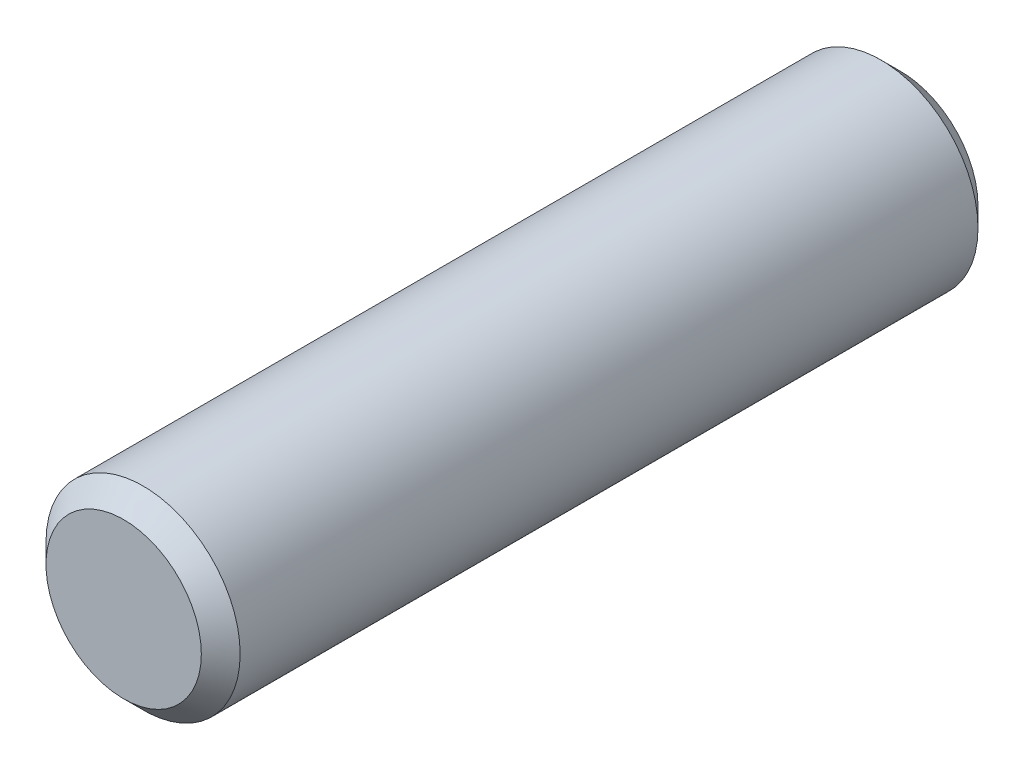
ISO-10303-21;
HEADER;
FILE_DESCRIPTION(('STEP AP214'),'2;1');
FILE_NAME('part.step','',(''),(''),'','','');
FILE_SCHEMA(('AUTOMOTIVE_DESIGN { 1 0 10303 214 1 1 1 1 }'));
ENDSEC;
DATA;
#1=APPLICATION_CONTEXT('core data for automotive mechanical design processes');
#2=APPLICATION_PROTOCOL_DEFINITION('international standard','automotive_design',2000,#1);
#3=PRODUCT_CONTEXT('',#1,'mechanical');
#4=PRODUCT('Part','Part','',(#3));
#5=PRODUCT_RELATED_PRODUCT_CATEGORY('part','',(#4));
#6=PRODUCT_DEFINITION_FORMATION('','',#4);
#7=PRODUCT_DEFINITION_CONTEXT('part definition',#1,'design');
#8=PRODUCT_DEFINITION('design','',#6,#7);
#9=PRODUCT_DEFINITION_SHAPE('','',#8);
#10=(LENGTH_UNIT() NAMED_UNIT(*) SI_UNIT(.MILLI.,.METRE.));
#11=(NAMED_UNIT(*) PLANE_ANGLE_UNIT() SI_UNIT($,.RADIAN.));
#12=(NAMED_UNIT(*) SI_UNIT($,.STERADIAN.) SOLID_ANGLE_UNIT());
#13=UNCERTAINTY_MEASURE_WITH_UNIT(LENGTH_MEASURE(1.E-05),#10,'distance_accuracy_value','');
#14=(GEOMETRIC_REPRESENTATION_CONTEXT(3) GLOBAL_UNCERTAINTY_ASSIGNED_CONTEXT((#13)) GLOBAL_UNIT_ASSIGNED_CONTEXT((#10,
#11,#12)) REPRESENTATION_CONTEXT('',''));
#15=CARTESIAN_POINT('',(0.,0.,0.));
#16=DIRECTION('',(0.,0.,1.));
#17=DIRECTION('',(1.,0.,0.));
#18=AXIS2_PLACEMENT_3D('',#15,#16,#17);
#19=CARTESIAN_POINT('',(-0.866025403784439,0.,1.2));
#20=DIRECTION('',(0.,0.,-1.));
#21=DIRECTION('',(-1.,0.,0.));
#22=AXIS2_PLACEMENT_3D('',#19,#20,#21);
#23=PLANE('',#22);
#24=DIRECTION('',(-1.,0.,0.));
#25=VECTOR('',#24,1.);
#26=CARTESIAN_POINT('',(0.433012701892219,-0.75,1.2));
#27=LINE('',#26,#25);
#28=CARTESIAN_POINT('',(0.433012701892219,-0.75,1.2));
#29=VERTEX_POINT('',#28);
#30=CARTESIAN_POINT('',(0.,-0.75,1.2));
#31=VERTEX_POINT('',#30);
#32=EDGE_CURVE('E174',#29,#31,#27,.T.);
#33=ORIENTED_EDGE('',*,*,#32,.T.);
#34=CARTESIAN_POINT('',(0.,0.,1.2));
#35=DIRECTION('',(0.,0.,1.));
#36=DIRECTION('',(0.,-1.,0.));
#37=AXIS2_PLACEMENT_3D('',#34,#35,#36);
#38=CIRCLE('',#37,0.75);
#39=CARTESIAN_POINT('',(0.649519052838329,-0.375,1.2));
#40=VERTEX_POINT('',#39);
#41=EDGE_CURVE('E48',#31,#40,#38,.T.);
#42=ORIENTED_EDGE('',*,*,#41,.T.);
#43=DIRECTION('',(-0.5,-0.866025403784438,0.));
#44=VECTOR('',#43,1.);
#45=CARTESIAN_POINT('',(0.866025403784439,0.,1.2));
#46=LINE('',#45,#44);
#47=EDGE_CURVE('E170',#40,#29,#46,.T.);
#48=ORIENTED_EDGE('',*,*,#47,.T.);
#49=EDGE_LOOP('',(#33,#42,#48));
#50=FACE_BOUND('',#49,.T.);
#51=ADVANCED_FACE('F33',(#50),#23,.T.);
#52=CARTESIAN_POINT('',(0.866025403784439,0.,1.2));
#53=VERTEX_POINT('',#52);
#54=EDGE_CURVE('E171',#53,#40,#46,.T.);
#55=ORIENTED_EDGE('',*,*,#54,.T.);
#56=CARTESIAN_POINT('',(0.649519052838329,0.375,1.2));
#57=VERTEX_POINT('',#56);
#58=EDGE_CURVE('E192',#40,#57,#38,.T.);
#59=ORIENTED_EDGE('',*,*,#58,.T.);
#60=DIRECTION('',(0.5,-0.866025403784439,0.));
#61=VECTOR('',#60,1.);
#62=CARTESIAN_POINT('',(0.433012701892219,0.75,1.2));
#63=LINE('',#62,#61);
#64=EDGE_CURVE('E166',#57,#53,#63,.T.);
#65=ORIENTED_EDGE('',*,*,#64,.T.);
#66=EDGE_LOOP('',(#55,#59,#65));
#67=FACE_BOUND('',#66,.T.);
#68=ADVANCED_FACE('F123',(#67),#23,.T.);
#69=CARTESIAN_POINT('',(0.433012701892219,0.75,1.2));
#70=VERTEX_POINT('',#69);
#71=EDGE_CURVE('E167',#70,#57,#63,.T.);
#72=ORIENTED_EDGE('',*,*,#71,.T.);
#73=CARTESIAN_POINT('',(0.,0.75,1.2));
#74=VERTEX_POINT('',#73);
#75=EDGE_CURVE('E263',#57,#74,#38,.T.);
#76=ORIENTED_EDGE('',*,*,#75,.T.);
#77=DIRECTION('',(1.,0.,0.));
#78=VECTOR('',#77,1.);
#79=CARTESIAN_POINT('',(-0.433012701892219,0.75,1.2));
#80=LINE('',#79,#78);
#81=EDGE_CURVE('E162',#74,#70,#80,.T.);
#82=ORIENTED_EDGE('',*,*,#81,.T.);
#83=EDGE_LOOP('',(#72,#76,#82));
#84=FACE_BOUND('',#83,.T.);
#85=ADVANCED_FACE('F129',(#84),#23,.T.);
#86=CARTESIAN_POINT('',(-0.433012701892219,0.75,1.2));
#87=VERTEX_POINT('',#86);
#88=EDGE_CURVE('E163',#87,#74,#80,.T.);
#89=ORIENTED_EDGE('',*,*,#88,.T.);
#90=CARTESIAN_POINT('',(-0.649519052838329,0.375,1.2));
#91=VERTEX_POINT('',#90);
#92=EDGE_CURVE('E262',#74,#91,#38,.T.);
#93=ORIENTED_EDGE('',*,*,#92,.T.);
#94=DIRECTION('',(0.5,0.866025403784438,0.));
#95=VECTOR('',#94,1.);
#96=CARTESIAN_POINT('',(-0.866025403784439,0.,1.2));
#97=LINE('',#96,#95);
#98=EDGE_CURVE('E152',#91,#87,#97,.T.);
#99=ORIENTED_EDGE('',*,*,#98,.T.);
#100=EDGE_LOOP('',(#89,#93,#99));
#101=FACE_BOUND('',#100,.T.);
#102=ADVANCED_FACE('F142',(#101),#23,.T.);
#103=CARTESIAN_POINT('',(-0.866025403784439,0.,1.2));
#104=VERTEX_POINT('',#103);
#105=EDGE_CURVE('E155',#104,#91,#97,.T.);
#106=ORIENTED_EDGE('',*,*,#105,.T.);
#107=CARTESIAN_POINT('',(-0.649519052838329,-0.375,1.2));
#108=VERTEX_POINT('',#107);
#109=EDGE_CURVE('E260',#91,#108,#38,.T.);
#110=ORIENTED_EDGE('',*,*,#109,.T.);
#111=DIRECTION('',(-0.5,0.866025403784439,0.));
#112=VECTOR('',#111,1.);
#113=CARTESIAN_POINT('',(-0.43301270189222,-0.75,1.2));
#114=LINE('',#113,#112);
#115=EDGE_CURVE('E153',#108,#104,#114,.T.);
#116=ORIENTED_EDGE('',*,*,#115,.T.);
#117=EDGE_LOOP('',(#106,#110,#116));
#118=FACE_BOUND('',#117,.T.);
#119=ADVANCED_FACE('F134',(#118),#23,.T.);
#120=CARTESIAN_POINT('',(-0.43301270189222,-0.75,1.2));
#121=VERTEX_POINT('',#120);
#122=EDGE_CURVE('E146',#121,#108,#114,.T.);
#123=ORIENTED_EDGE('',*,*,#122,.T.);
#124=EDGE_CURVE('E147',#108,#31,#38,.T.);
#125=ORIENTED_EDGE('',*,*,#124,.T.);
#126=EDGE_CURVE('E149',#31,#121,#27,.T.);
#127=ORIENTED_EDGE('',*,*,#126,.T.);
#128=EDGE_LOOP('',(#123,#125,#127));
#129=FACE_BOUND('',#128,.T.);
#130=ADVANCED_FACE('F125',(#129),#23,.T.);
#131=CARTESIAN_POINT('',(0.,0.,12.));
#132=DIRECTION('',(0.,0.,-1.));
#133=DIRECTION('',(-1.,0.,0.));
#134=AXIS2_PLACEMENT_3D('',#131,#132,#133);
#135=CYLINDRICAL_SURFACE('',#134,1.5);
#136=CARTESIAN_POINT('',(0.,0.,11.7));
#137=DIRECTION('',(0.,0.,1.));
#138=DIRECTION('',(1.,0.,0.));
#139=AXIS2_PLACEMENT_3D('',#136,#137,#138);
#140=CIRCLE('',#139,1.5);
#141=CARTESIAN_POINT('',(1.5,0.,11.7));
#142=VERTEX_POINT('',#141);
#143=EDGE_CURVE('E41',#142,#142,#140,.F.);
#144=ORIENTED_EDGE('',*,*,#143,.T.);
#145=EDGE_LOOP('',(#144));
#146=FACE_BOUND('',#145,.T.);
#147=CARTESIAN_POINT('',(0.,0.,0.299999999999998));
#148=DIRECTION('',(0.,0.,1.));
#149=DIRECTION('',(1.,0.,0.));
#150=AXIS2_PLACEMENT_3D('',#147,#148,#149);
#151=CIRCLE('',#150,1.5);
#152=CARTESIAN_POINT('',(1.5,0.,0.299999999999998));
#153=VERTEX_POINT('',#152);
#154=EDGE_CURVE('E191',#153,#153,#151,.T.);
#155=ORIENTED_EDGE('',*,*,#154,.T.);
#156=EDGE_LOOP('',(#155));
#157=FACE_BOUND('',#156,.T.);
#158=ADVANCED_FACE('F35',(#146,#157),#135,.T.);
#159=CARTESIAN_POINT('',(0.,0.,12.));
#160=DIRECTION('',(0.,0.,1.));
#161=DIRECTION('',(1.,0.,0.));
#162=AXIS2_PLACEMENT_3D('',#159,#160,#161);
#163=PLANE('',#162);
#164=CARTESIAN_POINT('',(0.,0.,12.));
#165=DIRECTION('',(0.,0.,1.));
#166=DIRECTION('',(1.,0.,0.));
#167=AXIS2_PLACEMENT_3D('',#164,#165,#166);
#168=CIRCLE('',#167,1.2);
#169=CARTESIAN_POINT('',(1.2,0.,12.));
#170=VERTEX_POINT('',#169);
#171=EDGE_CURVE('E188',#170,#170,#168,.T.);
#172=ORIENTED_EDGE('',*,*,#171,.T.);
#173=EDGE_LOOP('',(#172));
#174=FACE_BOUND('',#173,.T.);
#175=ADVANCED_FACE('F140',(#174),#163,.T.);
#176=CARTESIAN_POINT('',(0.,0.,0.));
#177=DIRECTION('',(0.,0.,1.));
#178=DIRECTION('',(1.,0.,0.));
#179=AXIS2_PLACEMENT_3D('',#176,#177,#178);
#180=PLANE('',#179);
#181=CARTESIAN_POINT('',(0.,0.,0.));
#182=DIRECTION('',(0.,0.,1.));
#183=DIRECTION('',(1.,0.,0.));
#184=AXIS2_PLACEMENT_3D('',#181,#182,#183);
#185=CIRCLE('',#184,1.2);
#186=CARTESIAN_POINT('',(1.2,0.,0.));
#187=VERTEX_POINT('',#186);
#188=EDGE_CURVE('E11',#187,#187,#185,.F.);
#189=ORIENTED_EDGE('',*,*,#188,.T.);
#190=EDGE_LOOP('',(#189));
#191=FACE_BOUND('',#190,.T.);
#192=DIRECTION('',(0.5,0.866025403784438,0.));
#193=VECTOR('',#192,1.);
#194=CARTESIAN_POINT('',(-0.866025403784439,0.,0.));
#195=LINE('',#194,#193);
#196=CARTESIAN_POINT('',(-0.866025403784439,0.,0.));
#197=VERTEX_POINT('',#196);
#198=CARTESIAN_POINT('',(-0.433012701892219,0.75,0.));
#199=VERTEX_POINT('',#198);
#200=EDGE_CURVE('E237',#197,#199,#195,.T.);
#201=ORIENTED_EDGE('',*,*,#200,.F.);
#202=DIRECTION('',(-0.5,0.866025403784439,0.));
#203=VECTOR('',#202,1.);
#204=CARTESIAN_POINT('',(-0.43301270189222,-0.75,0.));
#205=LINE('',#204,#203);
#206=CARTESIAN_POINT('',(-0.43301270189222,-0.75,0.));
#207=VERTEX_POINT('',#206);
#208=EDGE_CURVE('E56',#207,#197,#205,.T.);
#209=ORIENTED_EDGE('',*,*,#208,.F.);
#210=DIRECTION('',(-1.,0.,0.));
#211=VECTOR('',#210,1.);
#212=CARTESIAN_POINT('',(0.433012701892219,-0.75,0.));
#213=LINE('',#212,#211);
#214=CARTESIAN_POINT('',(0.433012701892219,-0.75,0.));
#215=VERTEX_POINT('',#214);
#216=EDGE_CURVE('E157',#215,#207,#213,.T.);
#217=ORIENTED_EDGE('',*,*,#216,.F.);
#218=DIRECTION('',(-0.5,-0.866025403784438,0.));
#219=VECTOR('',#218,1.);
#220=CARTESIAN_POINT('',(0.866025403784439,0.,0.));
#221=LINE('',#220,#219);
#222=CARTESIAN_POINT('',(0.866025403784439,0.,0.));
#223=VERTEX_POINT('',#222);
#224=EDGE_CURVE('E233',#223,#215,#221,.T.);
#225=ORIENTED_EDGE('',*,*,#224,.F.);
#226=DIRECTION('',(0.5,-0.866025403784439,0.));
#227=VECTOR('',#226,1.);
#228=CARTESIAN_POINT('',(0.433012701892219,0.75,0.));
#229=LINE('',#228,#227);
#230=CARTESIAN_POINT('',(0.433012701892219,0.75,0.));
#231=VERTEX_POINT('',#230);
#232=EDGE_CURVE('E245',#231,#223,#229,.T.);
#233=ORIENTED_EDGE('',*,*,#232,.F.);
#234=DIRECTION('',(1.,0.,0.));
#235=VECTOR('',#234,1.);
#236=CARTESIAN_POINT('',(-0.433012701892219,0.75,0.));
#237=LINE('',#236,#235);
#238=EDGE_CURVE('E239',#199,#231,#237,.T.);
#239=ORIENTED_EDGE('',*,*,#238,.F.);
#240=EDGE_LOOP('',(#201,#209,#217,#225,#233,#239));
#241=FACE_BOUND('',#240,.T.);
#242=ADVANCED_FACE('F201',(#191,#241),#180,.F.);
#243=CARTESIAN_POINT('',(-0.43301270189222,-0.75,1.2));
#244=DIRECTION('',(-0.866025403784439,-0.5,0.));
#245=DIRECTION('',(0.5,-0.866025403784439,0.));
#246=AXIS2_PLACEMENT_3D('',#243,#244,#245);
#247=PLANE('',#246);
#248=ORIENTED_EDGE('',*,*,#208,.T.);
#249=DIRECTION('',(0.,0.,-1.));
#250=VECTOR('',#249,1.);
#251=CARTESIAN_POINT('',(-0.866025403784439,0.,1.2));
#252=LINE('',#251,#250);
#253=EDGE_CURVE('E176',#104,#197,#252,.T.);
#254=ORIENTED_EDGE('',*,*,#253,.F.);
#255=ORIENTED_EDGE('',*,*,#115,.F.);
#256=ORIENTED_EDGE('',*,*,#122,.F.);
#257=DIRECTION('',(0.,0.,-1.));
#258=VECTOR('',#257,1.);
#259=CARTESIAN_POINT('',(-0.43301270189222,-0.75,1.2));
#260=LINE('',#259,#258);
#261=EDGE_CURVE('E177',#121,#207,#260,.T.);
#262=ORIENTED_EDGE('',*,*,#261,.T.);
#263=EDGE_LOOP('',(#248,#254,#255,#256,#262));
#264=FACE_BOUND('',#263,.T.);
#265=ADVANCED_FACE('F205',(#264),#247,.F.);
#266=CARTESIAN_POINT('',(0.433012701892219,-0.75,1.2));
#267=DIRECTION('',(0.,-1.,0.));
#268=DIRECTION('',(1.,0.,0.));
#269=AXIS2_PLACEMENT_3D('',#266,#267,#268);
#270=PLANE('',#269);
#271=ORIENTED_EDGE('',*,*,#216,.T.);
#272=ORIENTED_EDGE('',*,*,#261,.F.);
#273=ORIENTED_EDGE('',*,*,#126,.F.);
#274=ORIENTED_EDGE('',*,*,#32,.F.);
#275=DIRECTION('',(0.,0.,-1.));
#276=VECTOR('',#275,1.);
#277=CARTESIAN_POINT('',(0.433012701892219,-0.75,1.2));
#278=LINE('',#277,#276);
#279=EDGE_CURVE('E179',#29,#215,#278,.T.);
#280=ORIENTED_EDGE('',*,*,#279,.T.);
#281=EDGE_LOOP('',(#271,#272,#273,#274,#280));
#282=FACE_BOUND('',#281,.T.);
#283=ADVANCED_FACE('F210',(#282),#270,.F.);
#284=CARTESIAN_POINT('',(0.866025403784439,0.,1.2));
#285=DIRECTION('',(0.866025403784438,-0.5,0.));
#286=DIRECTION('',(0.5,0.866025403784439,0.));
#287=AXIS2_PLACEMENT_3D('',#284,#285,#286);
#288=PLANE('',#287);
#289=ORIENTED_EDGE('',*,*,#224,.T.);
#290=ORIENTED_EDGE('',*,*,#279,.F.);
#291=ORIENTED_EDGE('',*,*,#47,.F.);
#292=ORIENTED_EDGE('',*,*,#54,.F.);
#293=DIRECTION('',(0.,0.,-1.));
#294=VECTOR('',#293,1.);
#295=CARTESIAN_POINT('',(0.866025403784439,0.,1.2));
#296=LINE('',#295,#294);
#297=EDGE_CURVE('E181',#53,#223,#296,.T.);
#298=ORIENTED_EDGE('',*,*,#297,.T.);
#299=EDGE_LOOP('',(#289,#290,#291,#292,#298));
#300=FACE_BOUND('',#299,.T.);
#301=ADVANCED_FACE('F218',(#300),#288,.F.);
#302=CARTESIAN_POINT('',(0.433012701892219,0.75,1.2));
#303=DIRECTION('',(0.866025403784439,0.5,0.));
#304=DIRECTION('',(-0.5,0.866025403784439,0.));
#305=AXIS2_PLACEMENT_3D('',#302,#303,#304);
#306=PLANE('',#305);
#307=ORIENTED_EDGE('',*,*,#232,.T.);
#308=ORIENTED_EDGE('',*,*,#297,.F.);
#309=ORIENTED_EDGE('',*,*,#64,.F.);
#310=ORIENTED_EDGE('',*,*,#71,.F.);
#311=DIRECTION('',(0.,0.,-1.));
#312=VECTOR('',#311,1.);
#313=CARTESIAN_POINT('',(0.433012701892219,0.75,1.2));
#314=LINE('',#313,#312);
#315=EDGE_CURVE('E183',#70,#231,#314,.T.);
#316=ORIENTED_EDGE('',*,*,#315,.T.);
#317=EDGE_LOOP('',(#307,#308,#309,#310,#316));
#318=FACE_BOUND('',#317,.T.);
#319=ADVANCED_FACE('F214',(#318),#306,.F.);
#320=CARTESIAN_POINT('',(-0.433012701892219,0.75,1.2));
#321=DIRECTION('',(0.,1.,0.));
#322=DIRECTION('',(0.,0.,1.));
#323=AXIS2_PLACEMENT_3D('',#320,#321,#322);
#324=PLANE('',#323);
#325=ORIENTED_EDGE('',*,*,#238,.T.);
#326=ORIENTED_EDGE('',*,*,#315,.F.);
#327=ORIENTED_EDGE('',*,*,#81,.F.);
#328=ORIENTED_EDGE('',*,*,#88,.F.);
#329=DIRECTION('',(0.,0.,-1.));
#330=VECTOR('',#329,1.);
#331=CARTESIAN_POINT('',(-0.433012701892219,0.75,1.2));
#332=LINE('',#331,#330);
#333=EDGE_CURVE('E185',#87,#199,#332,.T.);
#334=ORIENTED_EDGE('',*,*,#333,.T.);
#335=EDGE_LOOP('',(#325,#326,#327,#328,#334));
#336=FACE_BOUND('',#335,.T.);
#337=ADVANCED_FACE('F118',(#336),#324,.F.);
#338=CARTESIAN_POINT('',(-0.866025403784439,0.,1.2));
#339=DIRECTION('',(-0.866025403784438,0.5,0.));
#340=DIRECTION('',(-0.5,-0.866025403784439,0.));
#341=AXIS2_PLACEMENT_3D('',#338,#339,#340);
#342=PLANE('',#341);
#343=ORIENTED_EDGE('',*,*,#200,.T.);
#344=ORIENTED_EDGE('',*,*,#333,.F.);
#345=ORIENTED_EDGE('',*,*,#98,.F.);
#346=ORIENTED_EDGE('',*,*,#105,.F.);
#347=ORIENTED_EDGE('',*,*,#253,.T.);
#348=EDGE_LOOP('',(#343,#344,#345,#346,#347));
#349=FACE_BOUND('',#348,.T.);
#350=ADVANCED_FACE('F109',(#349),#342,.F.);
#351=CARTESIAN_POINT('',(0.,0.,1.2));
#352=DIRECTION('',(0.,0.,-1.));
#353=DIRECTION('',(0.,1.,0.));
#354=AXIS2_PLACEMENT_3D('',#351,#352,#353);
#355=CONICAL_SURFACE('',#354,0.75,1.22173047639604);
#356=CARTESIAN_POINT('',(0.,0.,1.47297767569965));
#357=VERTEX_POINT('',#356);
#358=VERTEX_LOOP('',#357);
#359=FACE_BOUND('',#358,.T.);
#360=ORIENTED_EDGE('',*,*,#41,.F.);
#361=ORIENTED_EDGE('',*,*,#124,.F.);
#362=ORIENTED_EDGE('',*,*,#109,.F.);
#363=ORIENTED_EDGE('',*,*,#92,.F.);
#364=ORIENTED_EDGE('',*,*,#75,.F.);
#365=ORIENTED_EDGE('',*,*,#58,.F.);
#366=EDGE_LOOP('',(#360,#361,#362,#363,#364,#365));
#367=FACE_BOUND('',#366,.T.);
#368=ADVANCED_FACE('F106',(#359,#367),#355,.F.);
#369=CARTESIAN_POINT('',(0.,0.,12.));
#370=DIRECTION('',(0.,0.,-1.));
#371=DIRECTION('',(-1.,0.,0.));
#372=AXIS2_PLACEMENT_3D('',#369,#370,#371);
#373=CONICAL_SURFACE('',#372,1.2,0.785398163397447);
#374=ORIENTED_EDGE('',*,*,#143,.F.);
#375=EDGE_LOOP('',(#374));
#376=FACE_BOUND('',#375,.T.);
#377=ORIENTED_EDGE('',*,*,#171,.F.);
#378=EDGE_LOOP('',(#377));
#379=FACE_BOUND('',#378,.T.);
#380=ADVANCED_FACE('F108',(#376,#379),#373,.T.);
#381=CARTESIAN_POINT('',(0.,0.,0.299999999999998));
#382=DIRECTION('',(0.,0.,1.));
#383=DIRECTION('',(1.,0.,0.));
#384=AXIS2_PLACEMENT_3D('',#381,#382,#383);
#385=CONICAL_SURFACE('',#384,1.5,0.785398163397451);
#386=ORIENTED_EDGE('',*,*,#188,.F.);
#387=EDGE_LOOP('',(#386));
#388=FACE_BOUND('',#387,.T.);
#389=ORIENTED_EDGE('',*,*,#154,.F.);
#390=EDGE_LOOP('',(#389));
#391=FACE_BOUND('',#390,.T.);
#392=ADVANCED_FACE('F115',(#388,#391),#385,.T.);
#393=CLOSED_SHELL('',(#51,#68,#85,#102,#119,#130,#158,#175,#242,#265,#283,#301,#319,#337,#350,
#368,#380,#392));
#394=MANIFOLD_SOLID_BREP('B2',#393);
#395=ADVANCED_BREP_SHAPE_REPRESENTATION('',(#18,#394),#14);
#396=SHAPE_DEFINITION_REPRESENTATION(#9,#395);
ENDSEC;
END-ISO-10303-21;
